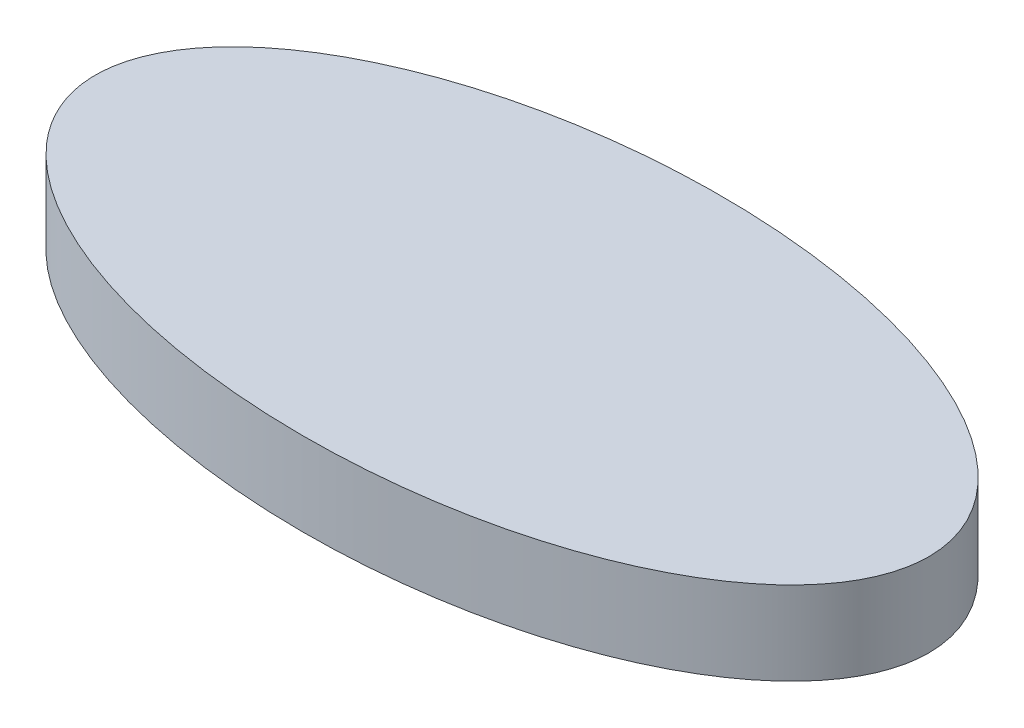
ISO-10303-21;
HEADER;
FILE_DESCRIPTION(('STEP AP214'),'2;1');
FILE_NAME('part.step','',(''),(''),'','','');
FILE_SCHEMA(('AUTOMOTIVE_DESIGN { 1 0 10303 214 1 1 1 1 }'));
ENDSEC;
DATA;
#1=APPLICATION_CONTEXT('core data for automotive mechanical design processes');
#2=APPLICATION_PROTOCOL_DEFINITION('international standard','automotive_design',2000,#1);
#3=PRODUCT_CONTEXT('',#1,'mechanical');
#4=PRODUCT('Part','Part','',(#3));
#5=PRODUCT_RELATED_PRODUCT_CATEGORY('part','',(#4));
#6=PRODUCT_DEFINITION_FORMATION('','',#4);
#7=PRODUCT_DEFINITION_CONTEXT('part definition',#1,'design');
#8=PRODUCT_DEFINITION('design','',#6,#7);
#9=PRODUCT_DEFINITION_SHAPE('','',#8);
#10=(LENGTH_UNIT() NAMED_UNIT(*) SI_UNIT(.MILLI.,.METRE.));
#11=(NAMED_UNIT(*) PLANE_ANGLE_UNIT() SI_UNIT($,.RADIAN.));
#12=(NAMED_UNIT(*) SI_UNIT($,.STERADIAN.) SOLID_ANGLE_UNIT());
#13=UNCERTAINTY_MEASURE_WITH_UNIT(LENGTH_MEASURE(1.E-05),#10,'distance_accuracy_value','');
#14=(GEOMETRIC_REPRESENTATION_CONTEXT(3) GLOBAL_UNCERTAINTY_ASSIGNED_CONTEXT((#13)) GLOBAL_UNIT_ASSIGNED_CONTEXT((#10,
#11,#12)) REPRESENTATION_CONTEXT('',''));
#15=CARTESIAN_POINT('',(0.,0.,0.));
#16=DIRECTION('',(0.,0.,1.));
#17=DIRECTION('',(1.,0.,0.));
#18=AXIS2_PLACEMENT_3D('',#15,#16,#17);
#19=CARTESIAN_POINT('',(0.,2.,0.));
#20=DIRECTION('',(0.,1.,0.));
#21=DIRECTION('',(1.,0.,0.));
#22=AXIS2_PLACEMENT_3D('',#19,#20,#21);
#23=ELLIPSE('',#22,10.,5.);
#24=DIRECTION('',(0.,-1.,0.));
#25=VECTOR('',#24,1.);
#26=SURFACE_OF_LINEAR_EXTRUSION('',#23,#25);
#27=CARTESIAN_POINT('',(10.,2.,0.));
#28=VERTEX_POINT('',#27);
#29=EDGE_CURVE('E10',#28,#28,#23,.T.);
#30=ORIENTED_EDGE('',*,*,#29,.F.);
#31=EDGE_LOOP('',(#30));
#32=FACE_BOUND('',#31,.T.);
#33=CARTESIAN_POINT('',(0.,0.,0.));
#34=DIRECTION('',(0.,1.,0.));
#35=DIRECTION('',(1.,0.,0.));
#36=AXIS2_PLACEMENT_3D('',#33,#34,#35);
#37=ELLIPSE('',#36,10.,5.);
#38=CARTESIAN_POINT('',(10.,0.,0.));
#39=VERTEX_POINT('',#38);
#40=EDGE_CURVE('E34',#39,#39,#37,.T.);
#41=ORIENTED_EDGE('',*,*,#40,.T.);
#42=EDGE_LOOP('',(#41));
#43=FACE_BOUND('',#42,.T.);
#44=ADVANCED_FACE('F30',(#32,#43),#26,.F.);
#45=CARTESIAN_POINT('',(0.,2.,0.));
#46=DIRECTION('',(0.,1.,0.));
#47=DIRECTION('',(0.,0.,1.));
#48=AXIS2_PLACEMENT_3D('',#45,#46,#47);
#49=PLANE('',#48);
#50=ORIENTED_EDGE('',*,*,#29,.T.);
#51=EDGE_LOOP('',(#50));
#52=FACE_BOUND('',#51,.T.);
#53=ADVANCED_FACE('F46',(#52),#49,.T.);
#54=CARTESIAN_POINT('',(0.,0.,0.));
#55=DIRECTION('',(0.,1.,0.));
#56=DIRECTION('',(0.,0.,1.));
#57=AXIS2_PLACEMENT_3D('',#54,#55,#56);
#58=PLANE('',#57);
#59=ORIENTED_EDGE('',*,*,#40,.F.);
#60=EDGE_LOOP('',(#59));
#61=FACE_BOUND('',#60,.T.);
#62=ADVANCED_FACE('F44',(#61),#58,.F.);
#63=CLOSED_SHELL('',(#44,#53,#62));
#64=MANIFOLD_SOLID_BREP('B2',#63);
#65=ADVANCED_BREP_SHAPE_REPRESENTATION('',(#18,#64),#14);
#66=SHAPE_DEFINITION_REPRESENTATION(#9,#65);
ENDSEC;
END-ISO-10303-21;
